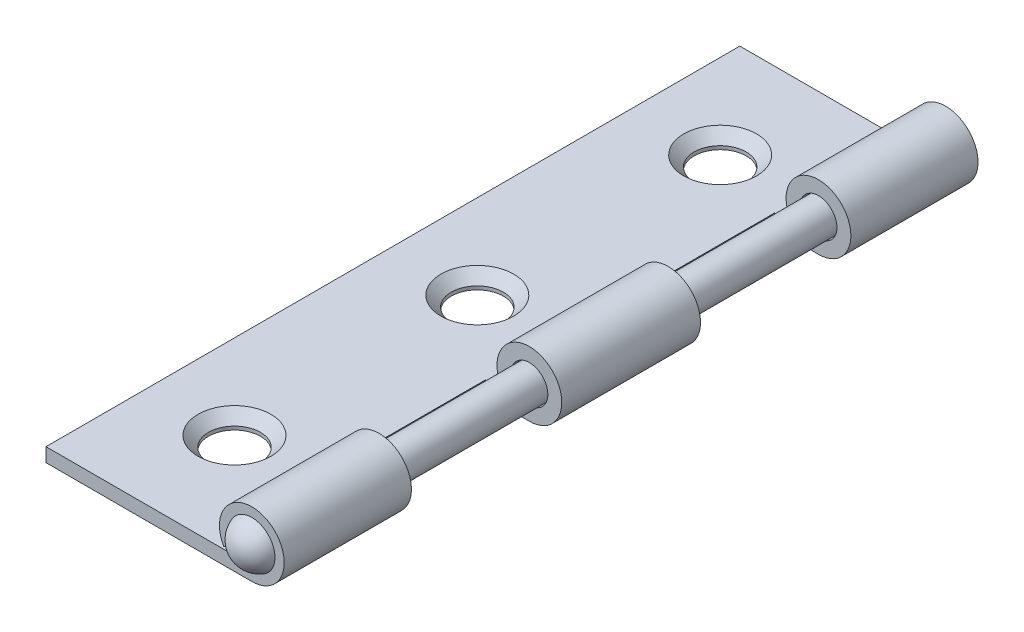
from build123d import *

# Parameters (mm, degrees)
BOSS_EXTRUDE1_DEPTH = 30
SKETCH2_R           = 2.25
CUT_EXTRUDE1_DEPTH  = 35.995428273
CHAMFER1_SIZE       = 0.9
SKETCH4_W           = 7.6
SKETCH4_H           = 13
CUT_EXTRUDE3_DEPTH  = 3.5


with BuildPart() as part:
    # Sketch1 → Boss-Extrude1 (new, symmetric)
    with BuildSketch(Plane.XY):
        with BuildLine():
            Line((0, -1.6), (-17.8, -1.6))
            Line((-17.8, -1.6), (-17.8, -2.8))
            Line((-17.8, -2.8), (0, -2.8))
            ThreePointArc((0, -2.8), (1.4, 2.424871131), (-2.424871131, -1.4))
            Line((-2.424871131, -1.4), (-1.385640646, -0.8))
            ThreePointArc((-1.385640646, -0.8), (0.8, 1.385640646), (0, -1.6))
        make_face()
    extrude(amount=BOSS_EXTRUDE1_DEPTH, both=True)

    # Sketch2 → Cut-Extrude1 (cut, through all)
    with BuildSketch(Plane(origin=(0, 0, 0), x_dir=(1, 0, 0), z_dir=(0, 1, 0))):
        with Locations(Location((-10.5, 0, 0), (0, 0, 270))):
            Circle(SKETCH2_R)
        with Locations(Location((-10.5, -21, 0), (0, 0, 270))):
            Circle(SKETCH2_R)
        with Locations(Location((-10.5, 21, 0), (0, 0, 270))):
            Circle(SKETCH2_R)
    extrude(amount=-CUT_EXTRUDE1_DEPTH, mode=Mode.SUBTRACT)

    # Chamfer1
    chamfer1_edges = [part.edges().sort_by_distance(p)[0] for p in [
        (-10.5, -1.6, -2.25),
        (-10.5, -1.6, 18.75),
        (-10.5, -1.6, -23.25),
    ]]
    chamfer(chamfer1_edges, length=CHAMFER1_SIZE)

    # Sketch4 → Cut-Extrude3 (cut, symmetric)
    with BuildSketch(Plane(origin=(0, 0, 0), x_dir=(1, 0, 0), z_dir=(0, 1, 0))):
        with Locations((0, 12.5)):
            Rectangle(SKETCH4_W, SKETCH4_H)
        with Locations((0, -12.5)):
            Rectangle(SKETCH4_W, SKETCH4_H)
    extrude(amount=CUT_EXTRUDE3_DEPTH, both=True, mode=Mode.SUBTRACT)


with BuildPart() as body_2:
    # Sketch5 → Revolve1 (revolve)
    with BuildSketch(Plane(origin=(0, 0, 0), x_dir=(1, 0, 0), z_dir=(0, 1, 0))):
        with BuildLine():
            Line((0, 31.45), (0, -31.45))
            ThreePointArc((0, -31.45), (-1.235161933, -31.049361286), (-2, -30))
            Line((-2, -30), (-1.5, -30))
            Line((-1.5, -30), (-1.5, 30))
            Line((-1.5, 30), (-2, 30))
            ThreePointArc((-2, 30), (-1.235161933, 31.049361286), (0, 31.45))
        make_face()
    revolve(axis=Axis((0, 0, -88.99), (0, 0, 1)))


solid = Compound([part.part, body_2.part])
